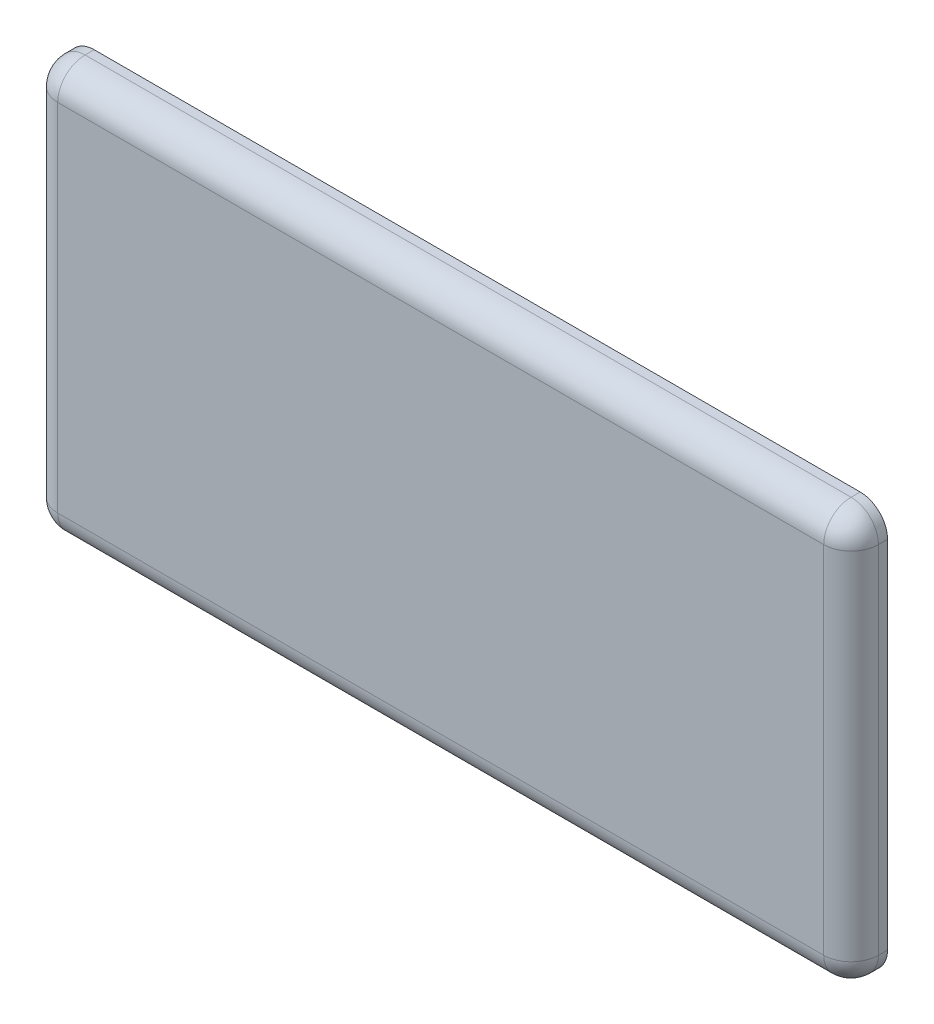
from build123d import *

# Parameters (mm, degrees)
SKETCH1_W           = 90
SKETCH1_H           = 45
BOSS_EXTRUDE1_DEPTH = 4
FILLET1_R           = 3
FILLET2_R           = 3
SKETCH2_W           = 74
SKETCH2_H           = 34
CUT_EXTRUDE1_DEPTH  = 1
BOSS_EXTRUDE2_DEPTH = 4.9
FILLET3_R           = 1
BOSS_EXTRUDE3_DEPTH = 9.5
LPATTERN1_COUNT     = 2
LPATTERN1_PITCH     = 45


with BuildPart() as part:
    # Sketch1 → Boss-Extrude1 (new body)
    with BuildSketch(Plane.XY):
        Rectangle(SKETCH1_W, SKETCH1_H)
    extrude(amount=BOSS_EXTRUDE1_DEPTH)

    # Fillet1
    fillet1_edges = [part.edges().sort_by_distance(p)[0] for p in [
        (-45, 22.5, 2),
        (45, 22.5, 2),
        (45, -22.5, 2),
        (-45, -22.5, 2),
    ]]
    fillet(fillet1_edges, radius=FILLET1_R)

    # Fillet2
    fillet2_edges = [part.edges().sort_by_distance(p)[0] for p in [
        (0, -22.5, 4),
        (-45, 0, 4),
        (45, 0, 4),
        (0, 22.5, 4),
        (-44.121320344, 21.621320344, 4),
        (44.121320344, 21.621320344, 4),
        (44.121320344, -21.621320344, 4),
        (-44.121320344, -21.621320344, 4),
    ]]
    fillet(fillet2_edges, radius=FILLET2_R)

    # Sketch2 → Cut-Extrude1 (cut)
    with BuildSketch(Plane(origin=(0, 0, 0), x_dir=(-1, 0, 0), z_dir=(0, 0, -1))):
        Rectangle(SKETCH2_W, SKETCH2_H)
    extrude(amount=-CUT_EXTRUDE1_DEPTH, mode=Mode.SUBTRACT)

    # Sketch3 → Boss-Extrude2 (add, symmetric)
    with BuildSketch(Plane(origin=(0, 0, 0), x_dir=(0, 0, -1), z_dir=(0, 1, 0))):
        Polygon((0, -37), (3, -38.091910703), (3, -39.7), (0, -39.7), align=None)
    extrude(amount=BOSS_EXTRUDE2_DEPTH, both=True)

    # Fillet3
    fillet3_edges = [part.edges().sort_by_distance(p)[0] for p in [
        (38.895955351, -4.9, -3),
        (38.895955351, 4.9, -3),
    ]]
    fillet(fillet3_edges, radius=FILLET3_R)

    # Sketch4 → Boss-Extrude3 (add)
    with BuildSketch(Plane(origin=(0, 0, 1), x_dir=(-1, 0, 0), z_dir=(0, 0, -1))):
        with BuildLine():
            Line((-25.801893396, -1), (-23.5, -1))
            Line((-23.5, -1), (-23.5, -3.301893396))
            ThreePointArc((-23.5, -3.301893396), (-22.5, -3.45), (-21.5, -3.301893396))
            Line((-21.5, -3.301893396), (-21.5, -1))
            Line((-21.5, -1), (-19.198106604, -1))
            ThreePointArc((-19.198106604, -1), (-19.05, 0), (-19.198106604, 1))
            Line((-19.198106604, 1), (-21.5, 1))
            Line((-21.5, 1), (-21.5, 3.301893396))
            ThreePointArc((-21.5, 3.301893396), (-22.5, 3.45), (-23.5, 3.301893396))
            Line((-23.5, 3.301893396), (-23.5, 1))
            Line((-23.5, 1), (-25.801893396, 1))
            ThreePointArc((-25.801893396, 1), (-25.95, 0), (-25.801893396, -1))
        make_face()
    boss_extrude3 = extrude(amount=BOSS_EXTRUDE3_DEPTH)

    # Sketch5 → Cut-Revolve1 (revolve, cut)
    with BuildSketch(Plane(origin=(0, 0, 0), x_dir=(0, 0, -1), z_dir=(0, 1, 0))):
        with BuildLine():
            Line((5.5, -19.05), (8.5, -19.05))
            Line((8.5, -19.05), (8.5, -19.998530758))
            ThreePointArc((8.5, -19.998530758), (8.383022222, -19.677136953), (8.086824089, -19.506126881))
            Line((8.086824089, -19.506126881), (5.5, -19.05))
        make_face()
    cut_revolve1 = revolve(axis=Axis((22.5, 0, 1), (0, 0, -1)), mode=Mode.SUBTRACT)

    # LPattern1: Boss-Extrude3, Cut-Revolve1 ×2
    with Locations(*[(-i * LPATTERN1_PITCH, 0, 0) for i in range(1, LPATTERN1_COUNT)]):
        add(boss_extrude3)
        add(cut_revolve1, mode=Mode.SUBTRACT)


solid = part.part
